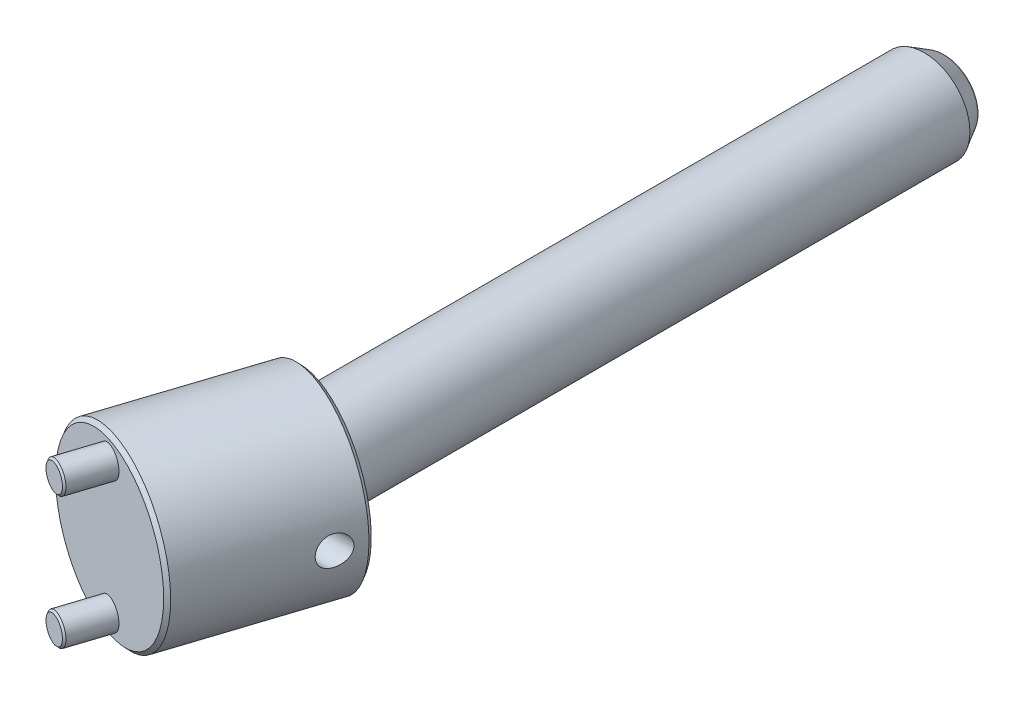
ISO-10303-21;
HEADER;
FILE_DESCRIPTION(('STEP AP214'),'2;1');
FILE_NAME('part.step','',(''),(''),'','','');
FILE_SCHEMA(('AUTOMOTIVE_DESIGN { 1 0 10303 214 1 1 1 1 }'));
ENDSEC;
DATA;
#1=APPLICATION_CONTEXT('core data for automotive mechanical design processes');
#2=APPLICATION_PROTOCOL_DEFINITION('international standard','automotive_design',2000,#1);
#3=PRODUCT_CONTEXT('',#1,'mechanical');
#4=PRODUCT('Part','Part','',(#3));
#5=PRODUCT_RELATED_PRODUCT_CATEGORY('part','',(#4));
#6=PRODUCT_DEFINITION_FORMATION('','',#4);
#7=PRODUCT_DEFINITION_CONTEXT('part definition',#1,'design');
#8=PRODUCT_DEFINITION('design','',#6,#7);
#9=PRODUCT_DEFINITION_SHAPE('','',#8);
#10=(LENGTH_UNIT() NAMED_UNIT(*) SI_UNIT(.MILLI.,.METRE.));
#11=(NAMED_UNIT(*) PLANE_ANGLE_UNIT() SI_UNIT($,.RADIAN.));
#12=(NAMED_UNIT(*) SI_UNIT($,.STERADIAN.) SOLID_ANGLE_UNIT());
#13=UNCERTAINTY_MEASURE_WITH_UNIT(LENGTH_MEASURE(1.E-05),#10,'distance_accuracy_value','');
#14=(GEOMETRIC_REPRESENTATION_CONTEXT(3) GLOBAL_UNCERTAINTY_ASSIGNED_CONTEXT((#13)) GLOBAL_UNIT_ASSIGNED_CONTEXT((#10,
#11,#12)) REPRESENTATION_CONTEXT('',''));
#15=CARTESIAN_POINT('',(0.,0.,0.));
#16=DIRECTION('',(0.,0.,1.));
#17=DIRECTION('',(1.,0.,0.));
#18=AXIS2_PLACEMENT_3D('',#15,#16,#17);
#19=CARTESIAN_POINT('',(0.,0.,-175.));
#20=DIRECTION('',(0.,0.,-1.));
#21=DIRECTION('',(0.,1.,0.));
#22=AXIS2_PLACEMENT_3D('',#19,#20,#21);
#23=PLANE('',#22);
#24=CARTESIAN_POINT('',(0.,0.,-175.));
#25=DIRECTION('',(0.,0.,1.));
#26=DIRECTION('',(-1.,0.,0.));
#27=AXIS2_PLACEMENT_3D('',#24,#25,#26);
#28=CIRCLE('',#27,7.881197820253);
#29=CARTESIAN_POINT('',(-7.881197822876,0.,-175.));
#30=VERTEX_POINT('',#29);
#31=CARTESIAN_POINT('',(7.881197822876,0.,-175.));
#32=VERTEX_POINT('',#31);
#33=EDGE_CURVE('P0_E38',#30,#32,#28,.T.);
#34=ORIENTED_EDGE('',*,*,#33,.F.);
#35=CARTESIAN_POINT('',(0.,0.,-175.));
#36=DIRECTION('',(0.,0.,1.));
#37=DIRECTION('',(1.,0.,0.));
#38=AXIS2_PLACEMENT_3D('',#35,#36,#37);
#39=CIRCLE('',#38,7.881197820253);
#40=EDGE_CURVE('P0_E42',#32,#30,#39,.T.);
#41=ORIENTED_EDGE('',*,*,#40,.F.);
#42=EDGE_LOOP('',(#34,#41));
#43=FACE_BOUND('',#42,.T.);
#44=ADVANCED_FACE('P0_F17',(#43),#23,.T.);
#45=CARTESIAN_POINT('',(0.,0.,-173.));
#46=DIRECTION('',(0.,0.,-1.));
#47=DIRECTION('',(0.999976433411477,-0.00686532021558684,0.));
#48=AXIS2_PLACEMENT_3D('',#45,#46,#47);
#49=TOROIDAL_SURFACE('',#48,7.881197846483,2.);
#50=ORIENTED_EDGE('',*,*,#33,.T.);
#51=ORIENTED_EDGE('',*,*,#40,.T.);
#52=EDGE_LOOP('',(#50,#51));
#53=FACE_BOUND('',#52,.T.);
#54=CARTESIAN_POINT('',(0.,0.,-174.000000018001));
#55=DIRECTION('',(0.,0.,1.));
#56=DIRECTION('',(1.,0.,0.));
#57=AXIS2_PLACEMENT_3D('',#54,#55,#56);
#58=CIRCLE('',#57,9.61324864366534);
#59=CARTESIAN_POINT('',(9.61324864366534,0.,-174.000000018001));
#60=VERTEX_POINT('',#59);
#61=EDGE_CURVE('P0_E48',#60,#60,#58,.T.);
#62=ORIENTED_EDGE('',*,*,#61,.F.);
#63=EDGE_LOOP('',(#62));
#64=FACE_BOUND('',#63,.T.);
#65=ADVANCED_FACE('P0_F40',(#53,#64),#49,.T.);
#66=CARTESIAN_POINT('',(0.,0.,37.5));
#67=DIRECTION('',(0.,0.,-1.));
#68=DIRECTION('',(0.,1.,0.));
#69=AXIS2_PLACEMENT_3D('',#66,#67,#68);
#70=PLANE('',#69);
#71=CARTESIAN_POINT('',(0.,0.,37.4999993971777));
#72=DIRECTION('',(0.,0.,-1.));
#73=DIRECTION('',(0.,1.,0.));
#74=AXIS2_PLACEMENT_3D('',#71,#72,#73);
#75=CIRCLE('',#74,11.4999991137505);
#76=CARTESIAN_POINT('',(0.,11.4999991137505,37.4999993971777));
#77=VERTEX_POINT('',#76);
#78=EDGE_CURVE('P0_E85',#77,#77,#75,.T.);
#79=ORIENTED_EDGE('',*,*,#78,.F.);
#80=EDGE_LOOP('',(#79));
#81=FACE_BOUND('',#80,.T.);
#82=ADVANCED_FACE('P0_F76',(#81),#70,.F.);
#83=CARTESIAN_POINT('',(4.30940107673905,0.,17.));
#84=DIRECTION('',(1.,0.,0.));
#85=DIRECTION('',(0.,0.,1.));
#86=AXIS2_PLACEMENT_3D('',#83,#84,#85);
#87=CONICAL_SURFACE('',#86,3.9999999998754,1.04719755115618);
#88=CARTESIAN_POINT('',(1.99999999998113,0.,16.9999999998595));
#89=VERTEX_POINT('',#88);
#90=VERTEX_LOOP('',#89);
#91=FACE_BOUND('',#90,.T.);
#92=CARTESIAN_POINT('',(4.309401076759,0.,17.));
#93=DIRECTION('',(1.,0.,0.));
#94=DIRECTION('',(0.,0.,1.));
#95=AXIS2_PLACEMENT_3D('',#92,#93,#94);
#96=CIRCLE('',#95,4.);
#97=CARTESIAN_POINT('',(4.309401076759,0.,21.));
#98=VERTEX_POINT('',#97);
#99=EDGE_CURVE('P0_E82',#98,#98,#96,.T.);
#100=ORIENTED_EDGE('',*,*,#99,.T.);
#101=EDGE_LOOP('',(#100));
#102=FACE_BOUND('',#101,.T.);
#103=ADVANCED_FACE('P0_F116',(#91,#102),#87,.F.);
#104=CARTESIAN_POINT('',(0.,0.,-169.000000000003));
#105=DIRECTION('',(0.,0.,1.));
#106=DIRECTION('',(0.,-1.,0.));
#107=AXIS2_PLACEMENT_3D('',#104,#105,#106);
#108=CONICAL_SURFACE('',#107,12.5000000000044,0.5235987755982);
#109=CARTESIAN_POINT('',(0.,0.,-169.));
#110=DIRECTION('',(0.,0.,-1.));
#111=DIRECTION('',(0.,1.,0.));
#112=AXIS2_PLACEMENT_3D('',#109,#110,#111);
#113=CIRCLE('',#112,12.5);
#114=CARTESIAN_POINT('',(0.,12.5,-169.));
#115=VERTEX_POINT('',#114);
#116=EDGE_CURVE('P0_E92',#115,#115,#113,.F.);
#117=ORIENTED_EDGE('',*,*,#116,.F.);
#118=EDGE_LOOP('',(#117));
#119=FACE_BOUND('',#118,.T.);
#120=ORIENTED_EDGE('',*,*,#61,.T.);
#121=EDGE_LOOP('',(#120));
#122=FACE_BOUND('',#121,.T.);
#123=ADVANCED_FACE('P0_F108',(#119,#122),#108,.T.);
#124=CARTESIAN_POINT('',(0.,0.,36.4999990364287));
#125=DIRECTION('',(0.,0.,-1.));
#126=DIRECTION('',(0.,1.,0.));
#127=AXIS2_PLACEMENT_3D('',#124,#125,#126);
#128=CONICAL_SURFACE('',#127,12.4999993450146,0.78539809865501);
#129=CARTESIAN_POINT('',(0.,0.,36.499999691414));
#130=DIRECTION('',(0.,0.,-1.));
#131=DIRECTION('',(0.,1.,0.));
#132=AXIS2_PLACEMENT_3D('',#129,#130,#131);
#133=CIRCLE('',#132,12.5);
#134=CARTESIAN_POINT('',(0.,12.5,36.499999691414));
#135=VERTEX_POINT('',#134);
#136=EDGE_CURVE('P0_E28',#135,#135,#133,.T.);
#137=ORIENTED_EDGE('',*,*,#136,.F.);
#138=EDGE_LOOP('',(#137));
#139=FACE_BOUND('',#138,.T.);
#140=ORIENTED_EDGE('',*,*,#78,.T.);
#141=EDGE_LOOP('',(#140));
#142=FACE_BOUND('',#141,.T.);
#143=ADVANCED_FACE('P0_F105',(#139,#142),#128,.T.);
#144=CARTESIAN_POINT('',(1.375,0.,17.));
#145=DIRECTION('',(1.,0.,0.));
#146=DIRECTION('',(0.,0.,1.));
#147=AXIS2_PLACEMENT_3D('',#144,#145,#146);
#148=CYLINDRICAL_SURFACE('',#147,4.);
#149=ORIENTED_EDGE('',*,*,#99,.F.);
#150=EDGE_LOOP('',(#149));
#151=FACE_BOUND('',#150,.T.);
#152=CARTESIAN_POINT('',(12.5,0.,21.));
#153=CARTESIAN_POINT('',(12.4999998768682,0.109267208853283,20.9999998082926));
#154=CARTESIAN_POINT('',(12.4985638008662,0.218537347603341,20.9955187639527));
#155=CARTESIAN_POINT('',(12.4928582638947,0.436308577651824,20.9776347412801));
#156=CARTESIAN_POINT('',(12.4885877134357,0.544809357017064,20.9642283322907));
#157=CARTESIAN_POINT('',(12.4773197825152,0.760358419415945,20.9285872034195));
#158=CARTESIAN_POINT('',(12.4703188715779,0.867404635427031,20.9063410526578));
#159=CARTESIAN_POINT('',(12.4537844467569,1.07914970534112,20.853228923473));
#160=CARTESIAN_POINT('',(12.4442499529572,1.18384763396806,20.8223596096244));
#161=CARTESIAN_POINT('',(12.412260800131,1.49277788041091,20.7173557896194));
#162=CARTESIAN_POINT('',(12.3863805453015,1.69256281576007,20.6307055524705));
#163=CARTESIAN_POINT('',(12.3281610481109,2.07458913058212,20.4268128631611));
#164=CARTESIAN_POINT('',(12.295822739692,2.25683304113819,20.3095748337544));
#165=CARTESIAN_POINT('',(12.2269279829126,2.60472253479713,20.043795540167));
#166=CARTESIAN_POINT('',(12.1902760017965,2.76972880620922,19.8944408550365));
#167=CARTESIAN_POINT('',(12.1174284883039,3.07283077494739,19.5704010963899));
#168=CARTESIAN_POINT('',(12.0812330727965,3.21091970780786,19.3957096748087));
#169=CARTESIAN_POINT('',(12.01237020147,3.45978450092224,19.0203675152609));
#170=CARTESIAN_POINT('',(11.9798194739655,3.56975347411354,18.8191582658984));
#171=CARTESIAN_POINT('',(11.9233663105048,3.75402351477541,18.399892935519));
#172=CARTESIAN_POINT('',(11.8994614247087,3.82833468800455,18.1818416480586));
#173=CARTESIAN_POINT('',(11.8640030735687,3.93682830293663,17.7422935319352));
#174=CARTESIAN_POINT('',(11.8520853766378,3.97219740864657,17.5211198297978));
#175=CARTESIAN_POINT('',(11.8408707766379,4.00551082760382,17.0756810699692));
#176=CARTESIAN_POINT('',(11.8415703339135,4.00346563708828,16.8514168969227));
#177=CARTESIAN_POINT('',(11.8551904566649,3.96293460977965,16.4160865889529));
#178=CARTESIAN_POINT('',(11.8676003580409,3.92597140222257,16.2048599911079));
#179=CARTESIAN_POINT('',(11.9024113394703,3.81912665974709,15.791778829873));
#180=CARTESIAN_POINT('',(11.9248135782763,3.74924130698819,15.5899253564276));
#181=CARTESIAN_POINT('',(11.9774670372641,3.5774893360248,15.1977500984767));
#182=CARTESIAN_POINT('',(12.0078322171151,3.47515345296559,15.0076498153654));
#183=CARTESIAN_POINT('',(12.0729382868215,3.2417276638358,14.6468343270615));
#184=CARTESIAN_POINT('',(12.107680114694,3.11063158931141,14.4761232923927));
#185=CARTESIAN_POINT('',(12.1796519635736,2.81604951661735,14.1503715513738));
#186=CARTESIAN_POINT('',(12.2169216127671,2.65131653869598,13.9964671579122));
#187=CARTESIAN_POINT('',(12.2883204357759,2.29773509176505,13.7180823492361));
#188=CARTESIAN_POINT('',(12.3224482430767,2.10887621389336,13.5936147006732));
#189=CARTESIAN_POINT('',(12.368603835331,1.8105187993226,13.4313785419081));
#190=CARTESIAN_POINT('',(12.3832112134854,1.70799133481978,13.3811846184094));
#191=CARTESIAN_POINT('',(12.4102662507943,1.49879447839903,13.2896595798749));
#192=CARTESIAN_POINT('',(12.4227147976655,1.39212681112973,13.2483248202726));
#193=CARTESIAN_POINT('',(12.4450730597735,1.17558171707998,13.1749428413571));
#194=CARTESIAN_POINT('',(12.4549867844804,1.0657096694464,13.1428809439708));
#195=CARTESIAN_POINT('',(12.4720081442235,0.843458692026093,13.0882661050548));
#196=CARTESIAN_POINT('',(12.4791170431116,0.731080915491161,13.0657088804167));
#197=CARTESIAN_POINT('',(12.4897717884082,0.515800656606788,13.0320501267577));
#198=CARTESIAN_POINT('',(12.4935992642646,0.413053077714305,13.0200402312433));
#199=CARTESIAN_POINT('',(12.498713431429,0.206871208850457,13.0040150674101));
#200=CARTESIAN_POINT('',(12.5000001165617,0.103436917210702,12.9999998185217));
#201=CARTESIAN_POINT('',(12.4999998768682,-0.109267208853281,13.0000001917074));
#202=CARTESIAN_POINT('',(12.4985638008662,-0.218537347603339,13.0044812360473));
#203=CARTESIAN_POINT('',(12.4928582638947,-0.436308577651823,13.0223652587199));
#204=CARTESIAN_POINT('',(12.4885877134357,-0.544809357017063,13.0357716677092));
#205=CARTESIAN_POINT('',(12.4773197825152,-0.760358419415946,13.0714127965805));
#206=CARTESIAN_POINT('',(12.4703188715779,-0.867404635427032,13.0936589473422));
#207=CARTESIAN_POINT('',(12.4537844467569,-1.07914970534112,13.146771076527));
#208=CARTESIAN_POINT('',(12.4442499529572,-1.18384763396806,13.1776403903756));
#209=CARTESIAN_POINT('',(12.412260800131,-1.4927778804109,13.2826442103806));
#210=CARTESIAN_POINT('',(12.3863805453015,-1.69256281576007,13.3692944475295));
#211=CARTESIAN_POINT('',(12.3281610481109,-2.07458913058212,13.5731871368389));
#212=CARTESIAN_POINT('',(12.295822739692,-2.25683304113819,13.6904251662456));
#213=CARTESIAN_POINT('',(12.2269279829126,-2.60472253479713,13.956204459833));
#214=CARTESIAN_POINT('',(12.1902760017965,-2.76972880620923,14.1055591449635));
#215=CARTESIAN_POINT('',(12.1174284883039,-3.0728307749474,14.4295989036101));
#216=CARTESIAN_POINT('',(12.0812330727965,-3.21091970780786,14.6042903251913));
#217=CARTESIAN_POINT('',(12.01237020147,-3.45978450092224,14.9796324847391));
#218=CARTESIAN_POINT('',(11.9798194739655,-3.56975347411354,15.1808417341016));
#219=CARTESIAN_POINT('',(11.9233663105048,-3.75402351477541,15.600107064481));
#220=CARTESIAN_POINT('',(11.8994614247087,-3.82833468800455,15.8181583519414));
#221=CARTESIAN_POINT('',(11.8640030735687,-3.93682830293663,16.2577064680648));
#222=CARTESIAN_POINT('',(11.8520853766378,-3.97219740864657,16.4788801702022));
#223=CARTESIAN_POINT('',(11.8408707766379,-4.00551082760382,16.9243189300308));
#224=CARTESIAN_POINT('',(11.8415703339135,-4.00346563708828,17.1485831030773));
#225=CARTESIAN_POINT('',(11.8551904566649,-3.96293460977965,17.583913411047));
#226=CARTESIAN_POINT('',(11.8676003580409,-3.92597140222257,17.7951400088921));
#227=CARTESIAN_POINT('',(11.9024113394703,-3.81912665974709,18.208221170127));
#228=CARTESIAN_POINT('',(11.9248135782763,-3.74924130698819,18.4100746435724));
#229=CARTESIAN_POINT('',(11.9774670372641,-3.5774893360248,18.8022499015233));
#230=CARTESIAN_POINT('',(12.0078322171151,-3.47515345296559,18.9923501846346));
#231=CARTESIAN_POINT('',(12.0729382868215,-3.2417276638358,19.3531656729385));
#232=CARTESIAN_POINT('',(12.107680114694,-3.11063158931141,19.5238767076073));
#233=CARTESIAN_POINT('',(12.1796519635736,-2.81604951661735,19.8496284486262));
#234=CARTESIAN_POINT('',(12.2169216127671,-2.65131653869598,20.0035328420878));
#235=CARTESIAN_POINT('',(12.2883204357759,-2.29773509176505,20.2819176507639));
#236=CARTESIAN_POINT('',(12.3224482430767,-2.10887621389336,20.4063852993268));
#237=CARTESIAN_POINT('',(12.368603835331,-1.8105187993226,20.5686214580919));
#238=CARTESIAN_POINT('',(12.3832112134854,-1.70799133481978,20.6188153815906));
#239=CARTESIAN_POINT('',(12.4102662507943,-1.49879447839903,20.7103404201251));
#240=CARTESIAN_POINT('',(12.4227147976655,-1.39212681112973,20.7516751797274));
#241=CARTESIAN_POINT('',(12.4450730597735,-1.17558171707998,20.8250571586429));
#242=CARTESIAN_POINT('',(12.4549867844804,-1.0657096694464,20.8571190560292));
#243=CARTESIAN_POINT('',(12.4720081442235,-0.843458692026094,20.9117338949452));
#244=CARTESIAN_POINT('',(12.4791170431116,-0.731080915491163,20.9342911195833));
#245=CARTESIAN_POINT('',(12.4897717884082,-0.515800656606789,20.9679498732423));
#246=CARTESIAN_POINT('',(12.4935992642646,-0.413053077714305,20.9799597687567));
#247=CARTESIAN_POINT('',(12.498713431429,-0.206871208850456,20.9959849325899));
#248=CARTESIAN_POINT('',(12.5000001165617,-0.103436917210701,21.0000001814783));
#249=CARTESIAN_POINT('',(12.5,0.,21.));
#250=B_SPLINE_CURVE_WITH_KNOTS('',3,(#152,#153,#154,#155,#156,#157,#158,#159,#160,#161,#162,
#163,#164,#165,#166,#167,#168,#169,#170,#171,#172,#173,#174,#175,#176,#177,#178,#179,#180,#181,
#182,#183,#184,#185,#186,#187,#188,#189,#190,#191,#192,#193,#194,#195,#196,#197,#198,#199,#200,
#201,#202,#203,#204,#205,#206,#207,#208,#209,#210,#211,#212,#213,#214,#215,#216,#217,#218,#219,
#220,#221,#222,#223,#224,#225,#226,#227,#228,#229,#230,#231,#232,#233,#234,#235,#236,#237,#238,
#239,#240,#241,#242,#243,#244,#245,#246,#247,#248,#249),.UNSPECIFIED.,.T.,.F.,(4,2,2,2,2,2,2,2,
2,2,2,2,2,2,2,2,2,2,2,2,2,2,2,2,2,2,2,2,2,2,2,2,2,2,2,2,2,2,2,2,2,2,2,2,2,2,2,2,4),(0.,
0.327705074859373,0.655536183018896,0.983792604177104,1.31217617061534,1.96678919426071,
2.62130761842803,3.29492000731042,3.96870146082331,4.66006760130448,5.35123768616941,
6.0207071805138,6.68998886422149,7.33137068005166,7.97282689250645,8.62401811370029,
9.27534913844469,9.95775723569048,10.6404607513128,10.9853574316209,11.3301119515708,
11.6743177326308,12.0183682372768,12.3285868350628,12.6388061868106,12.9665112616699,
13.2943423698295,13.6225987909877,13.9509823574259,14.6055953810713,15.2601138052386,
15.933726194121,16.6075076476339,17.298873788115,17.99004387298,18.6595133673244,
19.3287950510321,19.9701768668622,20.611633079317,21.2628243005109,21.9141553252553,
22.596563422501,23.2792669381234,23.6241636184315,23.9689181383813,24.3131239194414,
24.6571744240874,24.9673930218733,25.2776123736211),.UNSPECIFIED.);
#251=CARTESIAN_POINT('',(12.5,0.,21.));
#252=VERTEX_POINT('',#251);
#253=EDGE_CURVE('P0_E11',#252,#252,#250,.T.);
#254=ORIENTED_EDGE('',*,*,#253,.F.);
#255=EDGE_LOOP('',(#254));
#256=FACE_BOUND('',#255,.T.);
#257=ADVANCED_FACE('P0_F107',(#151,#256),#148,.F.);
#258=CARTESIAN_POINT('',(0.,0.,48.125));
#259=DIRECTION('',(0.,0.,-1.));
#260=DIRECTION('',(0.,1.,0.));
#261=AXIS2_PLACEMENT_3D('',#258,#259,#260);
#262=CYLINDRICAL_SURFACE('',#261,12.5);
#263=ORIENTED_EDGE('',*,*,#116,.T.);
#264=EDGE_LOOP('',(#263));
#265=FACE_BOUND('',#264,.T.);
#266=ORIENTED_EDGE('',*,*,#136,.T.);
#267=EDGE_LOOP('',(#266));
#268=FACE_BOUND('',#267,.T.);
#269=ORIENTED_EDGE('',*,*,#253,.T.);
#270=EDGE_LOOP('',(#269));
#271=FACE_BOUND('',#270,.T.);
#272=ADVANCED_FACE('P0_F102',(#265,#268,#271),#262,.T.);
#273=CLOSED_SHELL('',(#44,#65,#82,#103,#123,#143,#257,#272));
#274=MANIFOLD_SOLID_BREP('P0_B1',#273);
#275=CARTESIAN_POINT('',(-12.8586860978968,0.,55.7553064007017));
#276=DIRECTION('',(-0.309016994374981,0.,0.951056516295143));
#277=DIRECTION('',(-0.951056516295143,0.,-0.309016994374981));
#278=AXIS2_PLACEMENT_3D('',#275,#276,#277);
#279=PLANE('',#278);
#280=CARTESIAN_POINT('',(-12.8586860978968,18.,55.7553064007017));
#281=DIRECTION('',(-0.309016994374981,0.,0.951056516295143));
#282=DIRECTION('',(-0.951056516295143,0.,-0.309016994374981));
#283=AXIS2_PLACEMENT_3D('',#280,#281,#282);
#284=CIRCLE('',#283,3.50000030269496);
#285=CARTESIAN_POINT('',(-16.1873841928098,18.,54.6737468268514));
#286=VERTEX_POINT('',#285);
#287=EDGE_CURVE('P1_E17',#286,#286,#284,.F.);
#288=ORIENTED_EDGE('',*,*,#287,.F.);
#289=EDGE_LOOP('',(#288));
#290=FACE_BOUND('',#289,.T.);
#291=ADVANCED_FACE('P1_F14',(#290),#279,.T.);
#292=CARTESIAN_POINT('',(-12.8586860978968,0.,55.7553064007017));
#293=DIRECTION('',(-0.309016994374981,0.,0.951056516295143));
#294=DIRECTION('',(-0.951056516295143,0.,-0.309016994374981));
#295=AXIS2_PLACEMENT_3D('',#292,#293,#294);
#296=PLANE('',#295);
#297=CARTESIAN_POINT('',(-12.8586860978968,-18.,55.7553064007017));
#298=DIRECTION('',(-0.309016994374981,0.,0.951056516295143));
#299=DIRECTION('',(-0.951056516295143,0.,-0.309016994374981));
#300=AXIS2_PLACEMENT_3D('',#297,#298,#299);
#301=CIRCLE('',#300,3.50000030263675);
#302=CARTESIAN_POINT('',(-16.1873841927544,-18.,54.6737468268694));
#303=VERTEX_POINT('',#302);
#304=EDGE_CURVE('P1_E121',#303,#303,#301,.F.);
#305=ORIENTED_EDGE('',*,*,#304,.F.);
#306=EDGE_LOOP('',(#305));
#307=FACE_BOUND('',#306,.T.);
#308=ADVANCED_FACE('P1_F111',(#307),#296,.T.);
#309=CARTESIAN_POINT('',(6.40112962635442E-13,0.,37.5000000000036));
#310=DIRECTION('',(0.,0.,1.));
#311=DIRECTION('',(-1.,0.,0.));
#312=AXIS2_PLACEMENT_3D('',#309,#310,#311);
#313=PLANE('',#312);
#314=CARTESIAN_POINT('',(-3.95170007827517E-12,0.,37.5000000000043));
#315=DIRECTION('',(0.,0.,1.));
#316=DIRECTION('',(-1.,0.,0.));
#317=AXIS2_PLACEMENT_3D('',#314,#315,#316);
#318=CIRCLE('',#317,12.5);
#319=CARTESIAN_POINT('',(-12.500000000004,0.,37.5000000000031));
#320=VERTEX_POINT('',#319);
#321=EDGE_CURVE('P1_E36',#320,#320,#318,.F.);
#322=ORIENTED_EDGE('',*,*,#321,.T.);
#323=EDGE_LOOP('',(#322));
#324=FACE_BOUND('',#323,.T.);
#325=ADVANCED_FACE('P1_F108',(#324),#313,.F.);
#326=CARTESIAN_POINT('',(-12.7041772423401,18.,55.2797770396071));
#327=DIRECTION('',(0.309016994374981,0.,-0.951056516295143));
#328=DIRECTION('',(0.951056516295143,0.,0.309016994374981));
#329=AXIS2_PLACEMENT_3D('',#326,#327,#328);
#330=CONICAL_SURFACE('',#329,4.00000150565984,0.785398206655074);
#331=CARTESIAN_POINT('',(-12.7041767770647,18.,55.2797756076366));
#332=DIRECTION('',(-0.309016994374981,0.,0.951056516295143));
#333=DIRECTION('',(-0.951056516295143,0.,-0.309016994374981));
#334=AXIS2_PLACEMENT_3D('',#331,#332,#333);
#335=CIRCLE('',#334,4.);
#336=CARTESIAN_POINT('',(-16.5084028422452,18.,54.0437076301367));
#337=VERTEX_POINT('',#336);
#338=EDGE_CURVE('P1_E33',#337,#337,#335,.F.);
#339=ORIENTED_EDGE('',*,*,#338,.F.);
#340=EDGE_LOOP('',(#339));
#341=FACE_BOUND('',#340,.T.);
#342=ORIENTED_EDGE('',*,*,#287,.T.);
#343=EDGE_LOOP('',(#342));
#344=FACE_BOUND('',#343,.T.);
#345=ADVANCED_FACE('P1_F104',(#341,#344),#330,.T.);
#346=CARTESIAN_POINT('',(-12.7041772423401,-18.,55.2797770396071));
#347=DIRECTION('',(0.309016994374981,0.,-0.951056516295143));
#348=DIRECTION('',(0.951056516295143,0.,0.309016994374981));
#349=AXIS2_PLACEMENT_3D('',#346,#347,#348);
#350=CONICAL_SURFACE('',#349,4.00000150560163,0.785398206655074);
#351=CARTESIAN_POINT('',(-12.7041767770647,-18.,55.2797756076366));
#352=DIRECTION('',(-0.309016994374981,0.,0.951056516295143));
#353=DIRECTION('',(-0.951056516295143,0.,-0.309016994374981));
#354=AXIS2_PLACEMENT_3D('',#351,#352,#353);
#355=CIRCLE('',#354,4.);
#356=CARTESIAN_POINT('',(-16.5084028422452,-18.,54.0437076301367));
#357=VERTEX_POINT('',#356);
#358=EDGE_CURVE('P1_E29',#357,#357,#355,.F.);
#359=ORIENTED_EDGE('',*,*,#358,.F.);
#360=EDGE_LOOP('',(#359));
#361=FACE_BOUND('',#360,.T.);
#362=ORIENTED_EDGE('',*,*,#304,.T.);
#363=EDGE_LOOP('',(#362));
#364=FACE_BOUND('',#363,.T.);
#365=ADVANCED_FACE('P1_F99',(#361,#364),#350,.T.);
#366=CARTESIAN_POINT('',(1.1744077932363E-12,0.,-16.4160236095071));
#367=DIRECTION('',(0.,0.,1.));
#368=DIRECTION('',(-1.,0.,0.));
#369=AXIS2_PLACEMENT_3D('',#366,#367,#368);
#370=CYLINDRICAL_SURFACE('',#369,12.5);
#371=CARTESIAN_POINT('',(-3.88578058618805E-13,0.,3.0739299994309E-12));
#372=DIRECTION('',(0.309016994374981,0.,-0.951056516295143));
#373=DIRECTION('',(0.951056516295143,0.,0.309016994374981));
#374=AXIS2_PLACEMENT_3D('',#371,#372,#373);
#375=ELLIPSE('',#374,13.1432778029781,12.5);
#376=CARTESIAN_POINT('',(12.4999999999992,0.,4.06149620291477));
#377=VERTEX_POINT('',#376);
#378=EDGE_CURVE('P1_E32',#377,#377,#375,.F.);
#379=ORIENTED_EDGE('',*,*,#378,.F.);
#380=EDGE_LOOP('',(#379));
#381=FACE_BOUND('',#380,.T.);
#382=ORIENTED_EDGE('',*,*,#321,.F.);
#383=EDGE_LOOP('',(#382));
#384=FACE_BOUND('',#383,.T.);
#385=CARTESIAN_POINT('',(12.4999999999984,0.,13.0000000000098));
#386=CARTESIAN_POINT('',(12.4999998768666,0.109267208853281,13.0000001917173));
#387=CARTESIAN_POINT('',(12.4985638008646,0.218537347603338,13.0044812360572));
#388=CARTESIAN_POINT('',(12.4928582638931,0.436308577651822,13.0223652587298));
#389=CARTESIAN_POINT('',(12.488587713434,0.544809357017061,13.0357716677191));
#390=CARTESIAN_POINT('',(12.4773197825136,0.760358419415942,13.0714127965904));
#391=CARTESIAN_POINT('',(12.4703188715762,0.867404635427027,13.0936589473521));
#392=CARTESIAN_POINT('',(12.4537844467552,1.07914970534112,13.1467710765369));
#393=CARTESIAN_POINT('',(12.4442499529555,1.18384763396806,13.1776403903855));
#394=CARTESIAN_POINT('',(12.4122608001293,1.4927778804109,13.2826442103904));
#395=CARTESIAN_POINT('',(12.3863805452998,1.69256281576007,13.3692944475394));
#396=CARTESIAN_POINT('',(12.3281610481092,2.07458913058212,13.5731871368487));
#397=CARTESIAN_POINT('',(12.2958227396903,2.25683304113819,13.6904251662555));
#398=CARTESIAN_POINT('',(12.2269279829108,2.60472253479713,13.9562044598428));
#399=CARTESIAN_POINT('',(12.1902760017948,2.76972880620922,14.1055591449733));
#400=CARTESIAN_POINT('',(12.1174284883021,3.07283077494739,14.4295989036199));
#401=CARTESIAN_POINT('',(12.0812330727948,3.21091970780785,14.6042903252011));
#402=CARTESIAN_POINT('',(12.0123702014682,3.45978450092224,14.9796324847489));
#403=CARTESIAN_POINT('',(11.9798194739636,3.56975347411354,15.1808417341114));
#404=CARTESIAN_POINT('',(11.9233663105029,3.75402351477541,15.6001070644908));
#405=CARTESIAN_POINT('',(11.8994614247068,3.82833468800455,15.8181583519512));
#406=CARTESIAN_POINT('',(11.8640030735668,3.93682830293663,16.2577064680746));
#407=CARTESIAN_POINT('',(11.8520853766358,3.97219740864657,16.478880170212));
#408=CARTESIAN_POINT('',(11.8408707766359,4.00551082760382,16.9243189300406));
#409=CARTESIAN_POINT('',(11.8415703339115,4.00346563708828,17.1485831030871));
#410=CARTESIAN_POINT('',(11.8551904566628,3.96293460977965,17.5839134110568));
#411=CARTESIAN_POINT('',(11.8676003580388,3.92597140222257,17.7951400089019));
#412=CARTESIAN_POINT('',(11.9024113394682,3.81912665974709,18.2082211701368));
#413=CARTESIAN_POINT('',(11.9248135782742,3.74924130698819,18.4100746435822));
#414=CARTESIAN_POINT('',(11.977467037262,3.57748933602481,18.8022499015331));
#415=CARTESIAN_POINT('',(12.0078322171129,3.47515345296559,18.9923501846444));
#416=CARTESIAN_POINT('',(12.0729382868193,3.2417276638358,19.3531656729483));
#417=CARTESIAN_POINT('',(12.1076801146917,3.11063158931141,19.5238767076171));
#418=CARTESIAN_POINT('',(12.1796519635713,2.81604951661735,19.849628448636));
#419=CARTESIAN_POINT('',(12.2169216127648,2.65131653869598,20.0035328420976));
#420=CARTESIAN_POINT('',(12.2883204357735,2.29773509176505,20.2819176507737));
#421=CARTESIAN_POINT('',(12.3224482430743,2.10887621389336,20.4063852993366));
#422=CARTESIAN_POINT('',(12.3686038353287,1.81051879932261,20.5686214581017));
#423=CARTESIAN_POINT('',(12.383211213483,1.70799133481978,20.6188153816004));
#424=CARTESIAN_POINT('',(12.410266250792,1.49879447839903,20.710340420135));
#425=CARTESIAN_POINT('',(12.4227147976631,1.39212681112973,20.7516751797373));
#426=CARTESIAN_POINT('',(12.4450730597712,1.17558171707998,20.8250571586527));
#427=CARTESIAN_POINT('',(12.454986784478,1.0657096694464,20.8571190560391));
#428=CARTESIAN_POINT('',(12.4720081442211,0.843458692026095,20.911733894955));
#429=CARTESIAN_POINT('',(12.4791170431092,0.731080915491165,20.9342911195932));
#430=CARTESIAN_POINT('',(12.4897717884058,0.515800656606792,20.9679498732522));
#431=CARTESIAN_POINT('',(12.4935992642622,0.413053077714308,20.9799597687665));
#432=CARTESIAN_POINT('',(12.4987134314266,0.206871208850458,20.9959849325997));
#433=CARTESIAN_POINT('',(12.5000001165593,0.103436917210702,21.0000001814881));
#434=CARTESIAN_POINT('',(12.4999998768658,-0.109267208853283,20.9999998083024));
#435=CARTESIAN_POINT('',(12.4985638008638,-0.218537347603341,20.9955187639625));
#436=CARTESIAN_POINT('',(12.4928582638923,-0.436308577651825,20.9776347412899));
#437=CARTESIAN_POINT('',(12.4885877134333,-0.544809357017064,20.9642283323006));
#438=CARTESIAN_POINT('',(12.4773197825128,-0.760358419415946,20.9285872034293));
#439=CARTESIAN_POINT('',(12.4703188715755,-0.867404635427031,20.9063410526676));
#440=CARTESIAN_POINT('',(12.4537844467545,-1.07914970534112,20.8532289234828));
#441=CARTESIAN_POINT('',(12.4442499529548,-1.18384763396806,20.8223596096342));
#442=CARTESIAN_POINT('',(12.4122608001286,-1.4927778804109,20.7173557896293));
#443=CARTESIAN_POINT('',(12.3863805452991,-1.69256281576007,20.6307055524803));
#444=CARTESIAN_POINT('',(12.3281610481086,-2.07458913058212,20.4268128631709));
#445=CARTESIAN_POINT('',(12.2958227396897,-2.25683304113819,20.3095748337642));
#446=CARTESIAN_POINT('',(12.2269279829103,-2.60472253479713,20.0437955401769));
#447=CARTESIAN_POINT('',(12.1902760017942,-2.76972880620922,19.8944408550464));
#448=CARTESIAN_POINT('',(12.1174284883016,-3.07283077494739,19.5704010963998));
#449=CARTESIAN_POINT('',(12.0812330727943,-3.21091970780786,19.3957096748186));
#450=CARTESIAN_POINT('',(12.0123702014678,-3.45978450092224,19.0203675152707));
#451=CARTESIAN_POINT('',(11.9798194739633,-3.56975347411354,18.8191582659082));
#452=CARTESIAN_POINT('',(11.9233663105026,-3.75402351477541,18.3998929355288));
#453=CARTESIAN_POINT('',(11.8994614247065,-3.82833468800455,18.1818416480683));
#454=CARTESIAN_POINT('',(11.8640030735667,-3.93682830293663,17.742293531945));
#455=CARTESIAN_POINT('',(11.8520853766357,-3.97219740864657,17.5211198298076));
#456=CARTESIAN_POINT('',(11.8408707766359,-4.00551082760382,17.075681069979));
#457=CARTESIAN_POINT('',(11.8415703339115,-4.00346563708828,16.8514168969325));
#458=CARTESIAN_POINT('',(11.855190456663,-3.96293460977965,16.4160865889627));
#459=CARTESIAN_POINT('',(11.867600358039,-3.92597140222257,16.2048599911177));
#460=CARTESIAN_POINT('',(11.9024113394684,-3.81912665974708,15.7917788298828));
#461=CARTESIAN_POINT('',(11.9248135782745,-3.74924130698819,15.5899253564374));
#462=CARTESIAN_POINT('',(11.9774670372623,-3.5774893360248,15.1977500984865));
#463=CARTESIAN_POINT('',(12.0078322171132,-3.47515345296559,15.0076498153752));
#464=CARTESIAN_POINT('',(12.0729382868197,-3.2417276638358,14.6468343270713));
#465=CARTESIAN_POINT('',(12.1076801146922,-3.11063158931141,14.4761232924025));
#466=CARTESIAN_POINT('',(12.1796519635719,-2.81604951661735,14.1503715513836));
#467=CARTESIAN_POINT('',(12.2169216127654,-2.65131653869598,13.996467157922));
#468=CARTESIAN_POINT('',(12.2883204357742,-2.29773509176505,13.7180823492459));
#469=CARTESIAN_POINT('',(12.322448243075,-2.10887621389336,13.593614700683));
#470=CARTESIAN_POINT('',(12.3686038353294,-1.81051879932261,13.431378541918));
#471=CARTESIAN_POINT('',(12.3832112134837,-1.70799133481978,13.3811846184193));
#472=CARTESIAN_POINT('',(12.4102662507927,-1.49879447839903,13.2896595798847));
#473=CARTESIAN_POINT('',(12.4227147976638,-1.39212681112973,13.2483248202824));
#474=CARTESIAN_POINT('',(12.4450730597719,-1.17558171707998,13.174942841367));
#475=CARTESIAN_POINT('',(12.4549867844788,-1.0657096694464,13.1428809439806));
#476=CARTESIAN_POINT('',(12.4720081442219,-0.843458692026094,13.0882661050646));
#477=CARTESIAN_POINT('',(12.4791170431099,-0.731080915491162,13.0657088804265));
#478=CARTESIAN_POINT('',(12.4897717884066,-0.51580065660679,13.0320501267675));
#479=CARTESIAN_POINT('',(12.493599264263,-0.413053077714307,13.0200402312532));
#480=CARTESIAN_POINT('',(12.4987134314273,-0.206871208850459,13.00401506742));
#481=CARTESIAN_POINT('',(12.5000001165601,-0.103436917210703,12.9999998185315));
#482=CARTESIAN_POINT('',(12.4999999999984,0.,13.0000000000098));
#483=B_SPLINE_CURVE_WITH_KNOTS('',3,(#385,#386,#387,#388,#389,#390,#391,#392,#393,#394,#395,
#396,#397,#398,#399,#400,#401,#402,#403,#404,#405,#406,#407,#408,#409,#410,#411,#412,#413,#414,
#415,#416,#417,#418,#419,#420,#421,#422,#423,#424,#425,#426,#427,#428,#429,#430,#431,#432,#433,
#434,#435,#436,#437,#438,#439,#440,#441,#442,#443,#444,#445,#446,#447,#448,#449,#450,#451,#452,
#453,#454,#455,#456,#457,#458,#459,#460,#461,#462,#463,#464,#465,#466,#467,#468,#469,#470,#471,
#472,#473,#474,#475,#476,#477,#478,#479,#480,#481,#482),.UNSPECIFIED.,.T.,.F.,(4,2,2,2,2,2,2,2,
2,2,2,2,2,2,2,2,2,2,2,2,2,2,2,2,2,2,2,2,2,2,2,2,2,2,2,2,2,2,2,2,2,2,2,2,2,2,2,2,4),(0.,
0.327705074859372,0.655536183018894,0.983792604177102,1.31217617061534,1.9667891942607,
2.62130761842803,3.29492000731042,3.9687014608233,4.66006760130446,5.3512376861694,
6.0207071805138,6.68998886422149,7.33137068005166,7.97282689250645,8.62401811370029,
9.27534913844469,9.95775723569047,10.6404607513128,10.9853574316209,11.3301119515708,
11.6743177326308,12.0183682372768,12.3285868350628,12.6388061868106,12.9665112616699,
13.2943423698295,13.6225987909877,13.9509823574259,14.6055953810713,15.2601138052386,
15.933726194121,16.6075076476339,17.298873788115,17.99004387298,18.6595133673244,
19.3287950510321,19.9701768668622,20.611633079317,21.2628243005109,21.9141553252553,
22.596563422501,23.2792669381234,23.6241636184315,23.9689181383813,24.3131239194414,
24.6571744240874,24.9673930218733,25.2776123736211),.UNSPECIFIED.);
#484=CARTESIAN_POINT('',(12.4999999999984,0.,13.0000000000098));
#485=VERTEX_POINT('',#484);
#486=EDGE_CURVE('P1_E84',#485,#485,#483,.T.);
#487=ORIENTED_EDGE('',*,*,#486,.T.);
#488=EDGE_LOOP('',(#487));
#489=FACE_BOUND('',#488,.T.);
#490=ADVANCED_FACE('P1_F93',(#381,#384,#489),#370,.F.);
#491=CARTESIAN_POINT('',(-9.150482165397,18.,44.34262820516));
#492=DIRECTION('',(-0.309016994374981,0.,0.951056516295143));
#493=DIRECTION('',(-0.951056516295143,0.,-0.309016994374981));
#494=AXIS2_PLACEMENT_3D('',#491,#492,#493);
#495=CYLINDRICAL_SURFACE('',#494,4.);
#496=CARTESIAN_POINT('',(-9.150482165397,18.,44.34262820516));
#497=DIRECTION('',(-0.309016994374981,0.,0.951056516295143));
#498=DIRECTION('',(-0.951056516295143,0.,-0.309016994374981));
#499=AXIS2_PLACEMENT_3D('',#496,#497,#498);
#500=CIRCLE('',#499,4.);
#501=CARTESIAN_POINT('',(-12.9547082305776,18.,43.1065602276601));
#502=VERTEX_POINT('',#501);
#503=EDGE_CURVE('P1_E80',#502,#502,#500,.T.);
#504=ORIENTED_EDGE('',*,*,#503,.T.);
#505=EDGE_LOOP('',(#504));
#506=FACE_BOUND('',#505,.T.);
#507=ORIENTED_EDGE('',*,*,#338,.T.);
#508=EDGE_LOOP('',(#507));
#509=FACE_BOUND('',#508,.T.);
#510=ADVANCED_FACE('P1_F98',(#506,#509),#495,.T.);
#511=CARTESIAN_POINT('',(-9.150482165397,-18.,44.34262820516));
#512=DIRECTION('',(-0.309016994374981,0.,0.951056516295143));
#513=DIRECTION('',(-0.951056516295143,0.,-0.309016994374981));
#514=AXIS2_PLACEMENT_3D('',#511,#512,#513);
#515=CYLINDRICAL_SURFACE('',#514,4.);
#516=CARTESIAN_POINT('',(-9.150482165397,-18.,44.34262820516));
#517=DIRECTION('',(-0.309016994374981,0.,0.951056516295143));
#518=DIRECTION('',(-0.951056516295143,0.,-0.309016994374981));
#519=AXIS2_PLACEMENT_3D('',#516,#517,#518);
#520=CIRCLE('',#519,4.);
#521=CARTESIAN_POINT('',(-12.9547082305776,-18.,43.1065602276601));
#522=VERTEX_POINT('',#521);
#523=EDGE_CURVE('P1_E76',#522,#522,#520,.T.);
#524=ORIENTED_EDGE('',*,*,#523,.T.);
#525=EDGE_LOOP('',(#524));
#526=FACE_BOUND('',#525,.T.);
#527=ORIENTED_EDGE('',*,*,#358,.T.);
#528=EDGE_LOOP('',(#527));
#529=FACE_BOUND('',#528,.T.);
#530=ADVANCED_FACE('P1_F178',(#526,#529),#515,.T.);
#531=CARTESIAN_POINT('',(4.75528258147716,0.,1.54508497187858));
#532=DIRECTION('',(0.309016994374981,0.,-0.951056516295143));
#533=DIRECTION('',(0.951056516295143,0.,0.309016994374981));
#534=AXIS2_PLACEMENT_3D('',#531,#532,#533);
#535=PLANE('',#534);
#536=ORIENTED_EDGE('',*,*,#378,.T.);
#537=EDGE_LOOP('',(#536));
#538=FACE_BOUND('',#537,.T.);
#539=CARTESIAN_POINT('',(4.75528253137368,0.,1.5450851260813));
#540=DIRECTION('',(-0.309016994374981,0.,0.951056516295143));
#541=DIRECTION('',(-0.951056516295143,0.,-0.309016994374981));
#542=AXIS2_PLACEMENT_3D('',#539,#540,#541);
#543=CIRCLE('',#542,22.9999993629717);
#544=CARTESIAN_POINT('',(-17.1190167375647,0.,-5.56230554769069));
#545=VERTEX_POINT('',#544);
#546=EDGE_CURVE('P1_E46',#545,#545,#543,.T.);
#547=ORIENTED_EDGE('',*,*,#546,.F.);
#548=EDGE_LOOP('',(#547));
#549=FACE_BOUND('',#548,.T.);
#550=ADVANCED_FACE('P1_F71',(#538,#549),#535,.T.);
#551=CARTESIAN_POINT('',(-7.30480910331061,0.,17.000000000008));
#552=DIRECTION('',(1.,0.,0.));
#553=DIRECTION('',(0.,0.,1.));
#554=AXIS2_PLACEMENT_3D('',#551,#552,#553);
#555=CYLINDRICAL_SURFACE('',#554,4.);
#556=ORIENTED_EDGE('',*,*,#486,.F.);
#557=EDGE_LOOP('',(#556));
#558=FACE_BOUND('',#557,.T.);
#559=CARTESIAN_POINT('',(23.6690908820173,0.,21.0000000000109));
#560=CARTESIAN_POINT('',(23.6690908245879,0.111085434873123,20.999999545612));
#561=CARTESIAN_POINT('',(23.6697826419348,0.222182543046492,20.9953689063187));
#562=CARTESIAN_POINT('',(23.6725615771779,0.443632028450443,20.9768761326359));
#563=CARTESIAN_POINT('',(23.6746493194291,0.553984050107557,20.9630098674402));
#564=CARTESIAN_POINT('',(23.6802580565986,0.773282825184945,20.9261195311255));
#565=CARTESIAN_POINT('',(23.6837812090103,0.882227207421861,20.9030816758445));
#566=CARTESIAN_POINT('',(23.692315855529,1.0978026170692,20.8480138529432));
#567=CARTESIAN_POINT('',(23.6973279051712,1.20443276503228,20.8159805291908));
#568=CARTESIAN_POINT('',(23.7089043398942,1.41446054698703,20.7432124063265));
#569=CARTESIAN_POINT('',(23.7154669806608,1.51786166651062,20.7024873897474));
#570=CARTESIAN_POINT('',(23.7302346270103,1.72085933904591,20.6126124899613));
#571=CARTESIAN_POINT('',(23.7384402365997,1.82045447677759,20.5634595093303));
#572=CARTESIAN_POINT('',(23.7565780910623,2.01501547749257,20.4571651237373));
#573=CARTESIAN_POINT('',(23.7665089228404,2.109985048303,20.4000302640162));
#574=CARTESIAN_POINT('',(23.788201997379,2.2947495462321,20.2781665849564));
#575=CARTESIAN_POINT('',(23.7999649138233,2.38454255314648,20.2134349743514));
#576=CARTESIAN_POINT('',(23.8254156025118,2.55831153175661,20.0768904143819));
#577=CARTESIAN_POINT('',(23.8391037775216,2.64228628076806,20.0050759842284));
#578=CARTESIAN_POINT('',(23.8684926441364,2.80385663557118,19.8549178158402));
#579=CARTESIAN_POINT('',(23.8841940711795,2.88144989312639,19.776571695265));
#580=CARTESIAN_POINT('',(23.9176690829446,3.02968736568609,19.61401791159));
#581=CARTESIAN_POINT('',(23.9354420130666,3.10033376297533,19.529812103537));
#582=CARTESIAN_POINT('',(23.9731171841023,3.23428350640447,19.3561498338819));
#583=CARTESIAN_POINT('',(23.9930202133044,3.29758411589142,19.2666914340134));
#584=CARTESIAN_POINT('',(24.0351242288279,3.41686514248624,19.0825811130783));
#585=CARTESIAN_POINT('',(24.0573406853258,3.47278975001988,18.9878965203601));
#586=CARTESIAN_POINT('',(24.1039387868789,3.57648450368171,18.7946598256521));
#587=CARTESIAN_POINT('',(24.1283212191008,3.62425166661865,18.6961063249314));
#588=CARTESIAN_POINT('',(24.2046516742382,3.75489435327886,18.3958182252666));
#589=CARTESIAN_POINT('',(24.2598227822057,3.82522495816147,18.189279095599));
#590=CARTESIAN_POINT('',(24.379463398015,3.93261703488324,17.7641601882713));
#591=CARTESIAN_POINT('',(24.4441418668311,3.96873993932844,17.5454061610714));
#592=CARTESIAN_POINT('',(24.5802350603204,4.00461382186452,17.1069969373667));
#593=CARTESIAN_POINT('',(24.6516514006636,4.00435605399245,16.8873415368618));
#594=CARTESIAN_POINT('',(24.8028668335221,3.96749366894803,16.4420426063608));
#595=CARTESIAN_POINT('',(24.8829046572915,3.92912290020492,16.2166269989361));
#596=CARTESIAN_POINT('',(25.0455565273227,3.81503606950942,15.7763847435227));
#597=CARTESIAN_POINT('',(25.1281713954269,3.73930797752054,15.5615615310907));
#598=CARTESIAN_POINT('',(25.296577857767,3.54828412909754,15.1382703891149));
#599=CARTESIAN_POINT('',(25.3823441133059,3.43135355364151,14.9305294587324));
#600=CARTESIAN_POINT('',(25.5493480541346,3.16130301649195,14.5377071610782));
#601=CARTESIAN_POINT('',(25.6305853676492,3.00818008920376,14.3526276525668));
#602=CARTESIAN_POINT('',(25.7453598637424,2.75458604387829,14.0971417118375));
#603=CARTESIAN_POINT('',(25.7823429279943,2.6663532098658,14.0158678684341));
#604=CARTESIAN_POINT('',(25.8535092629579,2.48228698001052,13.8611014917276));
#605=CARTESIAN_POINT('',(25.8876938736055,2.38645726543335,13.7876052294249));
#606=CARTESIAN_POINT('',(25.952700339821,2.18772834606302,13.6491009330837));
#607=CARTESIAN_POINT('',(25.9835210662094,2.08482678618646,13.5840957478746));
#608=CARTESIAN_POINT('',(26.0412101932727,1.87268093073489,13.463341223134));
#609=CARTESIAN_POINT('',(26.0680791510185,1.76343753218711,13.40759057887));
#610=CARTESIAN_POINT('',(26.1153648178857,1.54831671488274,13.3100761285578));
#611=CARTESIAN_POINT('',(26.136123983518,1.44285781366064,13.2675543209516));
#612=CARTESIAN_POINT('',(26.1734325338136,1.22804070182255,13.1914708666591));
#613=CARTESIAN_POINT('',(26.1899825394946,1.11868306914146,13.1579078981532));
#614=CARTESIAN_POINT('',(26.2185016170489,0.897238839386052,13.1002538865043));
#615=CARTESIAN_POINT('',(26.2304830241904,0.785160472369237,13.0761373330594));
#616=CARTESIAN_POINT('',(26.2496670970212,0.559003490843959,13.0375946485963));
#617=CARTESIAN_POINT('',(26.2568731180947,0.444926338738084,13.0231617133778));
#618=CARTESIAN_POINT('',(26.2638906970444,0.275464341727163,13.0091153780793));
#619=CARTESIAN_POINT('',(26.2655988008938,0.220444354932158,13.0056986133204));
#620=CARTESIAN_POINT('',(26.2678778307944,0.110285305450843,13.0011406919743));
#621=CARTESIAN_POINT('',(26.2684487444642,0.0551462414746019,12.9999995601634));
#622=CARTESIAN_POINT('',(26.2684478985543,-0.104291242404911,13.0000008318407));
#623=CARTESIAN_POINT('',(26.2664043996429,-0.208608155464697,13.00408454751));
#624=CARTESIAN_POINT('',(26.2582653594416,-0.416488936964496,13.0203744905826));
#625=CARTESIAN_POINT('',(26.2521675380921,-0.520052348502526,13.0325852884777));
#626=CARTESIAN_POINT('',(26.2360119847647,-0.725807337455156,13.0650205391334));
#627=CARTESIAN_POINT('',(26.2259469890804,-0.827996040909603,13.0852596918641));
#628=CARTESIAN_POINT('',(26.2020391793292,-1.03008364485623,13.1335103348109));
#629=CARTESIAN_POINT('',(26.1881948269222,-1.12998159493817,13.161524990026));
#630=CARTESIAN_POINT('',(26.1414446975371,-1.42441798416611,13.2565587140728));
#631=CARTESIAN_POINT('',(26.1032433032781,-1.6146622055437,13.3347224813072));
#632=CARTESIAN_POINT('',(26.0150788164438,-1.97861808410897,13.5176669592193));
#633=CARTESIAN_POINT('',(25.9651188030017,-2.15233405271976,13.6224407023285));
#634=CARTESIAN_POINT('',(25.8532790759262,-2.48845408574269,13.8611809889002));
#635=CARTESIAN_POINT('',(25.7909238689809,-2.64983984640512,13.9963571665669));
#636=CARTESIAN_POINT('',(25.6591691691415,-2.948133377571,14.2885141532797));
#637=CARTESIAN_POINT('',(25.5897665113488,-3.0850300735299,14.4455047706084));
#638=CARTESIAN_POINT('',(25.4399133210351,-3.34413955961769,14.7935946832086));
#639=CARTESIAN_POINT('',(25.3590432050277,-3.46365631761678,14.9865239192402));
#640=CARTESIAN_POINT('',(25.1958395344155,-3.66833710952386,15.389297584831));
#641=CARTESIAN_POINT('',(25.1135054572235,-3.75348860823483,15.5991481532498));
#642=CARTESIAN_POINT('',(24.946101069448,-3.89103892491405,16.0426000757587));
#643=CARTESIAN_POINT('',(24.8611263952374,-3.94139839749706,16.2768725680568));
#644=CARTESIAN_POINT('',(24.6963071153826,-3.99951305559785,16.7525990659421));
#645=CARTESIAN_POINT('',(24.6164622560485,-4.00727034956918,16.9940527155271));
#646=CARTESIAN_POINT('',(24.5032033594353,-3.98607743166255,17.3541778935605));
#647=CARTESIAN_POINT('',(24.4667608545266,-3.97373382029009,17.4730772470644));
#648=CARTESIAN_POINT('',(24.3960369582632,-3.93831803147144,17.7099001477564));
#649=CARTESIAN_POINT('',(24.3617546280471,-3.91525055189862,17.8278240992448));
#650=CARTESIAN_POINT('',(24.2955577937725,-3.85839046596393,18.0617539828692));
#651=CARTESIAN_POINT('',(24.2636437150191,-3.82459593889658,18.1777595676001));
#652=CARTESIAN_POINT('',(24.2023612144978,-3.74641132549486,18.4067808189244));
#653=CARTESIAN_POINT('',(24.1729916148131,-3.70202617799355,18.5197978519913));
#654=CARTESIAN_POINT('',(24.118345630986,-3.60544483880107,18.7361055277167));
#655=CARTESIAN_POINT('',(24.0929360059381,-3.5537725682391,18.8395967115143));
#656=CARTESIAN_POINT('',(24.0445449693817,-3.44140253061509,19.0420943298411));
#657=CARTESIAN_POINT('',(24.0215624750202,-3.3807088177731,19.1411027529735));
#658=CARTESIAN_POINT('',(23.9780149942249,-3.25064969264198,19.333836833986));
#659=CARTESIAN_POINT('',(23.957450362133,-3.18128301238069,19.4275617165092));
#660=CARTESIAN_POINT('',(23.9187169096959,-3.03438792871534,19.6088491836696));
#661=CARTESIAN_POINT('',(23.9005470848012,-2.95686297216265,19.6964143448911));
#662=CARTESIAN_POINT('',(23.8672305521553,-2.79755199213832,19.8611689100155));
#663=CARTESIAN_POINT('',(23.851990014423,-2.71607395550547,19.9386374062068));
#664=CARTESIAN_POINT('',(23.8235677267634,-2.54671180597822,20.0865668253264));
#665=CARTESIAN_POINT('',(23.8103851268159,-2.45883036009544,20.1570306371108));
#666=CARTESIAN_POINT('',(23.7859689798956,-2.27719181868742,20.2904567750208));
#667=CARTESIAN_POINT('',(23.7747368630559,-2.18343047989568,20.3534135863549));
#668=CARTESIAN_POINT('',(23.7541362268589,-1.99080558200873,20.4712295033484));
#669=CARTESIAN_POINT('',(23.7447669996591,-1.89194397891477,20.5260916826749));
#670=CARTESIAN_POINT('',(23.7279135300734,-1.69133303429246,20.6265392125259));
#671=CARTESIAN_POINT('',(23.7204030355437,-1.58964956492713,20.6722517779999));
#672=CARTESIAN_POINT('',(23.7069981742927,-1.38276891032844,20.7550443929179));
#673=CARTESIAN_POINT('',(23.7011031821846,-1.27757310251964,20.7921277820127));
#674=CARTESIAN_POINT('',(23.6908537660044,-1.06454972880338,20.8573467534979));
#675=CARTESIAN_POINT('',(23.6864969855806,-0.956726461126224,20.8854960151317));
#676=CARTESIAN_POINT('',(23.6792488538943,-0.739101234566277,20.9326986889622));
#677=CARTESIAN_POINT('',(23.6763568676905,-0.629300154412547,20.9517560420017));
#678=CARTESIAN_POINT('',(23.6724741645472,-0.432906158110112,20.9774508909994));
#679=CARTESIAN_POINT('',(23.6712044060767,-0.346551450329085,20.9859030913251));
#680=CARTESIAN_POINT('',(23.6695127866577,-0.173466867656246,20.997177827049));
#681=CARTESIAN_POINT('',(23.669090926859,-0.0867369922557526,21.0000003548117));
#682=CARTESIAN_POINT('',(23.6690908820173,0.,21.0000000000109));
#683=B_SPLINE_CURVE_WITH_KNOTS('',3,(#559,#560,#561,#562,#563,#564,#565,#566,#567,#568,#569,
#570,#571,#572,#573,#574,#575,#576,#577,#578,#579,#580,#581,#582,#583,#584,#585,#586,#587,#588,
#589,#590,#591,#592,#593,#594,#595,#596,#597,#598,#599,#600,#601,#602,#603,#604,#605,#606,#607,
#608,#609,#610,#611,#612,#613,#614,#615,#616,#617,#618,#619,#620,#621,#622,#623,#624,#625,#626,
#627,#628,#629,#630,#631,#632,#633,#634,#635,#636,#637,#638,#639,#640,#641,#642,#643,#644,#645,
#646,#647,#648,#649,#650,#651,#652,#653,#654,#655,#656,#657,#658,#659,#660,#661,#662,#663,#664,
#665,#666,#667,#668,#669,#670,#671,#672,#673,#674,#675,#676,#677,#678,#679,#680,#681,#682),
.UNSPECIFIED.,.T.,.F.,(4,2,2,2,2,2,2,2,2,2,2,2,2,2,2,2,2,2,2,2,2,2,2,2,2,2,2,2,2,2,2,2,2,2,2,2,
2,2,2,2,2,2,2,2,2,2,2,2,2,2,2,2,2,2,2,2,2,2,2,2,2,4),(0.,0.333178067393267,0.666505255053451,
1.00033530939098,1.33429007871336,1.66787094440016,2.00157467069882,2.33500634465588,
2.6685609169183,3.00218537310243,3.335932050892,3.66957354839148,4.00333894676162,
4.33950026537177,4.67578425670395,5.3477175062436,6.03759397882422,6.72763629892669,
7.45122044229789,8.17503775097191,8.93159540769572,9.68821507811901,10.0643993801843,
10.4404024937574,10.816531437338,11.192607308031,11.538901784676,11.8851451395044,
12.2304468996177,12.575505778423,12.7409133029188,12.9063226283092,13.2191407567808,
13.5321349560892,13.8457049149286,14.159402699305,14.7838992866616,15.4082325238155,
16.0641817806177,16.7204269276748,17.4400670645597,18.1599694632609,18.919130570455,
19.6782541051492,20.052767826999,20.4271176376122,20.8015345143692,21.1757771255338,
21.5306275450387,21.8853189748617,22.2400623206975,22.5946563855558,22.9346133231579,
23.2744294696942,23.6144937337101,23.9544285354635,24.2892461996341,24.6239340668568,
24.9581069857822,25.292134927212,25.5522844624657,25.8124343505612),.UNSPECIFIED.);
#684=CARTESIAN_POINT('',(23.6690908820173,0.,21.0000000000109));
#685=VERTEX_POINT('',#684);
#686=EDGE_CURVE('P1_E39',#685,#685,#683,.T.);
#687=ORIENTED_EDGE('',*,*,#686,.F.);
#688=EDGE_LOOP('',(#687));
#689=FACE_BOUND('',#688,.T.);
#690=ADVANCED_FACE('P1_F48',(#558,#689),#555,.F.);
#691=CARTESIAN_POINT('',(-9.150482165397,0.,44.34262820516));
#692=DIRECTION('',(0.309016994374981,0.,-0.951056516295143));
#693=DIRECTION('',(0.951056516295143,0.,0.309016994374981));
#694=AXIS2_PLACEMENT_3D('',#691,#692,#693);
#695=PLANE('',#694);
#696=ORIENTED_EDGE('',*,*,#523,.F.);
#697=EDGE_LOOP('',(#696));
#698=FACE_BOUND('',#697,.T.);
#699=ORIENTED_EDGE('',*,*,#503,.F.);
#700=EDGE_LOOP('',(#699));
#701=FACE_BOUND('',#700,.T.);
#702=CARTESIAN_POINT('',(-9.1504821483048,0.,44.3426281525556));
#703=DIRECTION('',(0.309016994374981,0.,-0.951056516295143));
#704=DIRECTION('',(0.951056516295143,0.,0.309016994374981));
#705=AXIS2_PLACEMENT_3D('',#702,#703,#704);
#706=CIRCLE('',#705,22.9999993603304);
#707=CARTESIAN_POINT('',(12.7238171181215,0.,51.4500188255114));
#708=VERTEX_POINT('',#707);
#709=EDGE_CURVE('P1_E26',#708,#708,#706,.T.);
#710=ORIENTED_EDGE('',*,*,#709,.F.);
#711=EDGE_LOOP('',(#710));
#712=FACE_BOUND('',#711,.T.);
#713=ADVANCED_FACE('P1_F63',(#698,#701,#712),#695,.F.);
#714=CARTESIAN_POINT('',(4.44626538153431,0.,2.49614212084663));
#715=DIRECTION('',(-0.309016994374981,0.,0.951056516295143));
#716=DIRECTION('',(-0.951056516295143,0.,-0.309016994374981));
#717=AXIS2_PLACEMENT_3D('',#714,#715,#716);
#718=CONICAL_SURFACE('',#717,23.9999998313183,0.785398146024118);
#719=ORIENTED_EDGE('',*,*,#546,.T.);
#720=EDGE_LOOP('',(#719));
#721=FACE_BOUND('',#720,.T.);
#722=CARTESIAN_POINT('',(4.44626543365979,0.,2.49614196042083));
#723=DIRECTION('',(0.309016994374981,0.,-0.951056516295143));
#724=DIRECTION('',(0.951056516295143,0.,0.309016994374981));
#725=AXIS2_PLACEMENT_3D('',#722,#723,#724);
#726=CIRCLE('',#725,24.);
#727=CARTESIAN_POINT('',(27.2716218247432,0.,9.91254982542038));
#728=VERTEX_POINT('',#727);
#729=EDGE_CURVE('P1_E21',#728,#728,#726,.F.);
#730=ORIENTED_EDGE('',*,*,#729,.F.);
#731=EDGE_LOOP('',(#730));
#732=FACE_BOUND('',#731,.T.);
#733=ADVANCED_FACE('P1_F60',(#721,#732),#718,.T.);
#734=CARTESIAN_POINT('',(-8.84146496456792,0.,43.3915710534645));
#735=DIRECTION('',(0.309016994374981,0.,-0.951056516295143));
#736=DIRECTION('',(0.951056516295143,0.,0.309016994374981));
#737=AXIS2_PLACEMENT_3D('',#734,#735,#736);
#738=CONICAL_SURFACE('',#737,23.9999999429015,0.785398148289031);
#739=CARTESIAN_POINT('',(-8.84146498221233,0.,43.3915711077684));
#740=DIRECTION('',(0.309016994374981,0.,-0.951056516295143));
#741=DIRECTION('',(0.951056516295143,0.,0.309016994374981));
#742=AXIS2_PLACEMENT_3D('',#739,#740,#741);
#743=CIRCLE('',#742,24.);
#744=CARTESIAN_POINT('',(13.9838914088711,0.,50.8079789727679));
#745=VERTEX_POINT('',#744);
#746=EDGE_CURVE('P1_E9',#745,#745,#743,.T.);
#747=ORIENTED_EDGE('',*,*,#746,.F.);
#748=EDGE_LOOP('',(#747));
#749=FACE_BOUND('',#748,.T.);
#750=ORIENTED_EDGE('',*,*,#709,.T.);
#751=EDGE_LOOP('',(#750));
#752=FACE_BOUND('',#751,.T.);
#753=ADVANCED_FACE('P1_F56',(#749,#752),#738,.T.);
#754=CARTESIAN_POINT('',(-9.84577040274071,0.,46.4825053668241));
#755=DIRECTION('',(0.309016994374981,0.,-0.951056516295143));
#756=DIRECTION('',(0.951056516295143,0.,0.309016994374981));
#757=AXIS2_PLACEMENT_3D('',#754,#755,#756);
#758=CYLINDRICAL_SURFACE('',#757,24.);
#759=ORIENTED_EDGE('',*,*,#729,.T.);
#760=EDGE_LOOP('',(#759));
#761=FACE_BOUND('',#760,.T.);
#762=ORIENTED_EDGE('',*,*,#746,.T.);
#763=EDGE_LOOP('',(#762));
#764=FACE_BOUND('',#763,.T.);
#765=ORIENTED_EDGE('',*,*,#686,.T.);
#766=EDGE_LOOP('',(#765));
#767=FACE_BOUND('',#766,.T.);
#768=ADVANCED_FACE('P1_F52',(#761,#764,#767),#758,.T.);
#769=CLOSED_SHELL('',(#291,#308,#325,#345,#365,#490,#510,#530,#550,#690,#713,#733,#753,#768));
#770=MANIFOLD_SOLID_BREP('P1_B1',#769);
#771=ADVANCED_BREP_SHAPE_REPRESENTATION('',(#18,#274,#770),#14);
#772=SHAPE_DEFINITION_REPRESENTATION(#9,#771);
ENDSEC;
END-ISO-10303-21;
